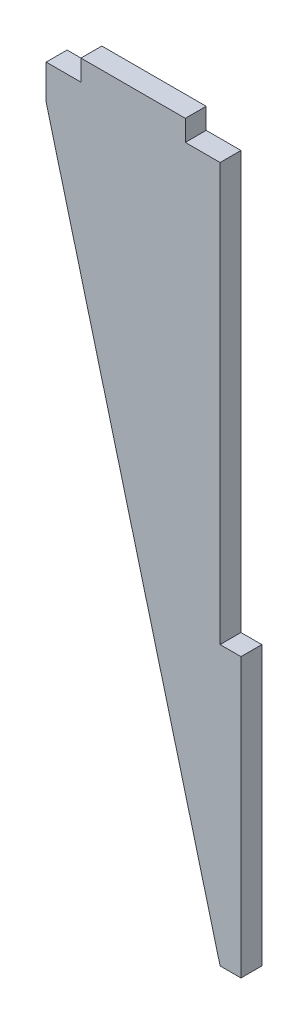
from build123d import *

# Parameters (mm, degrees)
BOSS_EXTRU_1_DEPTH = 3


with BuildPart() as part:
    # Esquisse1 → Boss.-Extru.1 (new body)
    with BuildSketch(Plane.XY):
        Polygon((-67, -100), (-70, -100), (-95, -5), (-95, 0), (-90, 0), (-90, 3), (-75, 3), (-75, 0), (-70, 0), (-70, -60), (-67, -60), align=None)
    extrude(amount=BOSS_EXTRU_1_DEPTH)


solid = part.part
